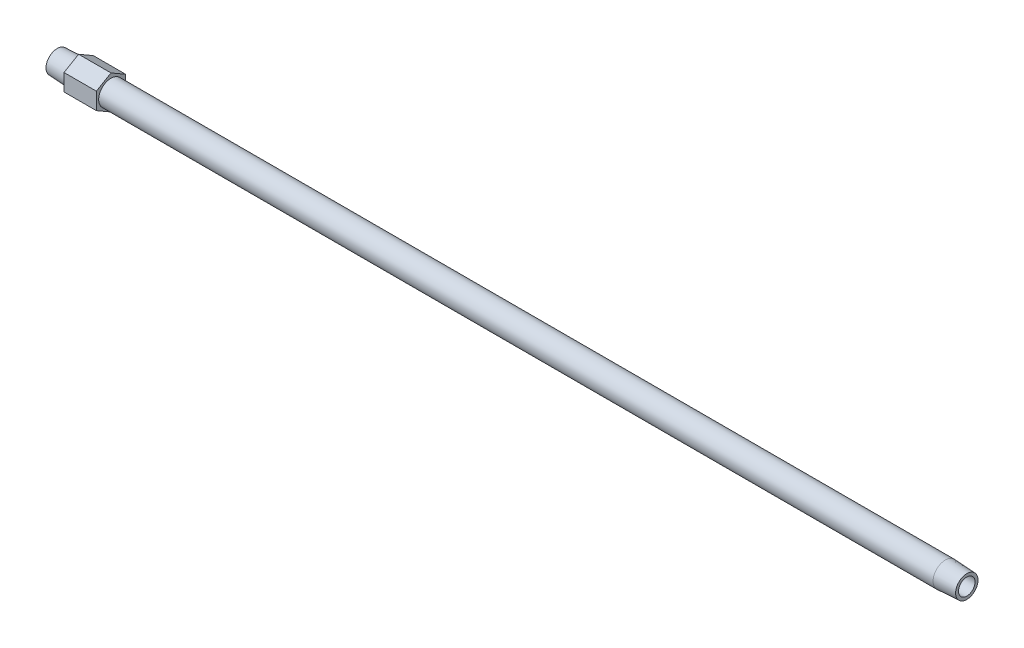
ISO-10303-21;
HEADER;
FILE_DESCRIPTION(('STEP AP214'),'2;1');
FILE_NAME('part.step','',(''),(''),'','','');
FILE_SCHEMA(('AUTOMOTIVE_DESIGN { 1 0 10303 214 1 1 1 1 }'));
ENDSEC;
DATA;
#1=APPLICATION_CONTEXT('core data for automotive mechanical design processes');
#2=APPLICATION_PROTOCOL_DEFINITION('international standard','automotive_design',2000,#1);
#3=PRODUCT_CONTEXT('',#1,'mechanical');
#4=PRODUCT('Part','Part','',(#3));
#5=PRODUCT_RELATED_PRODUCT_CATEGORY('part','',(#4));
#6=PRODUCT_DEFINITION_FORMATION('','',#4);
#7=PRODUCT_DEFINITION_CONTEXT('part definition',#1,'design');
#8=PRODUCT_DEFINITION('design','',#6,#7);
#9=PRODUCT_DEFINITION_SHAPE('','',#8);
#10=(LENGTH_UNIT() NAMED_UNIT(*) SI_UNIT(.MILLI.,.METRE.));
#11=(NAMED_UNIT(*) PLANE_ANGLE_UNIT() SI_UNIT($,.RADIAN.));
#12=(NAMED_UNIT(*) SI_UNIT($,.STERADIAN.) SOLID_ANGLE_UNIT());
#13=UNCERTAINTY_MEASURE_WITH_UNIT(LENGTH_MEASURE(1.E-05),#10,'distance_accuracy_value','');
#14=(GEOMETRIC_REPRESENTATION_CONTEXT(3) GLOBAL_UNCERTAINTY_ASSIGNED_CONTEXT((#13)) GLOBAL_UNIT_ASSIGNED_CONTEXT((#10,
#11,#12)) REPRESENTATION_CONTEXT('',''));
#15=CARTESIAN_POINT('',(0.,0.,0.));
#16=DIRECTION('',(0.,0.,1.));
#17=DIRECTION('',(1.,0.,0.));
#18=AXIS2_PLACEMENT_3D('',#15,#16,#17);
#19=CARTESIAN_POINT('',(0.,0.,-3.59899397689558));
#20=DIRECTION('',(1.,0.,0.));
#21=DIRECTION('',(0.,0.,-1.));
#22=AXIS2_PLACEMENT_3D('',#19,#20,#21);
#23=PLANE('',#22);
#24=CARTESIAN_POINT('',(0.,0.,0.));
#25=DIRECTION('',(-1.,0.,0.));
#26=DIRECTION('',(0.,0.,1.));
#27=AXIS2_PLACEMENT_3D('',#24,#25,#26);
#28=CIRCLE('',#27,3.59899397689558);
#29=CARTESIAN_POINT('',(0.,0.,3.59899397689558));
#30=VERTEX_POINT('',#29);
#31=EDGE_CURVE('E147',#30,#30,#28,.T.);
#32=ORIENTED_EDGE('',*,*,#31,.T.);
#33=EDGE_LOOP('',(#32));
#34=FACE_BOUND('',#33,.T.);
#35=CARTESIAN_POINT('',(0.,0.,0.));
#36=DIRECTION('',(1.,0.,0.));
#37=DIRECTION('',(0.,0.,1.));
#38=AXIS2_PLACEMENT_3D('',#35,#36,#37);
#39=CIRCLE('',#38,2.6543);
#40=CARTESIAN_POINT('',(0.,0.,2.6543));
#41=VERTEX_POINT('',#40);
#42=EDGE_CURVE('E159',#41,#41,#39,.T.);
#43=ORIENTED_EDGE('',*,*,#42,.T.);
#44=EDGE_LOOP('',(#43));
#45=FACE_BOUND('',#44,.T.);
#46=ADVANCED_FACE('F15',(#34,#45),#23,.F.);
#47=CARTESIAN_POINT('',(292.1,0.,-3.59899397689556));
#48=DIRECTION('',(-1.,0.,0.));
#49=DIRECTION('',(0.,0.,1.));
#50=AXIS2_PLACEMENT_3D('',#47,#48,#49);
#51=PLANE('',#50);
#52=CARTESIAN_POINT('',(292.1,0.,0.));
#53=DIRECTION('',(-1.,0.,0.));
#54=DIRECTION('',(0.,0.,1.));
#55=AXIS2_PLACEMENT_3D('',#52,#53,#54);
#56=CIRCLE('',#55,3.59899397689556);
#57=CARTESIAN_POINT('',(292.1,0.,3.59899397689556));
#58=VERTEX_POINT('',#57);
#59=EDGE_CURVE('E150',#58,#58,#56,.T.);
#60=ORIENTED_EDGE('',*,*,#59,.F.);
#61=EDGE_LOOP('',(#60));
#62=FACE_BOUND('',#61,.T.);
#63=CARTESIAN_POINT('',(292.1,0.,0.));
#64=DIRECTION('',(-1.,0.,0.));
#65=DIRECTION('',(0.,0.,1.));
#66=AXIS2_PLACEMENT_3D('',#63,#64,#65);
#67=CIRCLE('',#66,2.6543);
#68=CARTESIAN_POINT('',(292.1,0.,2.6543));
#69=VERTEX_POINT('',#68);
#70=EDGE_CURVE('E156',#69,#69,#67,.F.);
#71=ORIENTED_EDGE('',*,*,#70,.F.);
#72=EDGE_LOOP('',(#71));
#73=FACE_BOUND('',#72,.T.);
#74=ADVANCED_FACE('F178',(#62,#73),#51,.F.);
#75=CARTESIAN_POINT('',(17.272,-2.71296891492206,-4.699));
#76=DIRECTION('',(1.,0.,0.));
#77=DIRECTION('',(0.,1.,0.));
#78=AXIS2_PLACEMENT_3D('',#75,#76,#77);
#79=PLANE('',#78);
#80=DIRECTION('',(0.,0.5,-0.866025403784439));
#81=VECTOR('',#80,1.);
#82=CARTESIAN_POINT('',(17.272,-5.4259378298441,0.));
#83=LINE('',#82,#81);
#84=CARTESIAN_POINT('',(17.272,-5.4259378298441,0.));
#85=VERTEX_POINT('',#84);
#86=CARTESIAN_POINT('',(17.272,-2.71296891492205,-4.699));
#87=VERTEX_POINT('',#86);
#88=EDGE_CURVE('E103',#85,#87,#83,.T.);
#89=ORIENTED_EDGE('',*,*,#88,.T.);
#90=DIRECTION('',(0.,1.,0.));
#91=VECTOR('',#90,1.);
#92=CARTESIAN_POINT('',(17.272,-2.71296891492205,-4.699));
#93=LINE('',#92,#91);
#94=CARTESIAN_POINT('',(17.272,2.71296891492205,-4.699));
#95=VERTEX_POINT('',#94);
#96=EDGE_CURVE('E83',#87,#95,#93,.T.);
#97=ORIENTED_EDGE('',*,*,#96,.T.);
#98=DIRECTION('',(0.,0.5,0.866025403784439));
#99=VECTOR('',#98,1.);
#100=CARTESIAN_POINT('',(17.272,2.71296891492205,-4.699));
#101=LINE('',#100,#99);
#102=CARTESIAN_POINT('',(17.272,5.4259378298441,0.));
#103=VERTEX_POINT('',#102);
#104=EDGE_CURVE('E102',#95,#103,#101,.T.);
#105=ORIENTED_EDGE('',*,*,#104,.T.);
#106=DIRECTION('',(0.,-0.5,0.866025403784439));
#107=VECTOR('',#106,1.);
#108=CARTESIAN_POINT('',(17.272,5.4259378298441,0.));
#109=LINE('',#108,#107);
#110=CARTESIAN_POINT('',(17.272,2.71296891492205,4.699));
#111=VERTEX_POINT('',#110);
#112=EDGE_CURVE('E105',#103,#111,#109,.T.);
#113=ORIENTED_EDGE('',*,*,#112,.T.);
#114=DIRECTION('',(0.,-1.,0.));
#115=VECTOR('',#114,1.);
#116=CARTESIAN_POINT('',(17.272,2.71296891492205,4.699));
#117=LINE('',#116,#115);
#118=CARTESIAN_POINT('',(17.272,-2.71296891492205,4.699));
#119=VERTEX_POINT('',#118);
#120=EDGE_CURVE('E35',#111,#119,#117,.T.);
#121=ORIENTED_EDGE('',*,*,#120,.T.);
#122=DIRECTION('',(0.,-0.5,-0.866025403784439));
#123=VECTOR('',#122,1.);
#124=CARTESIAN_POINT('',(17.272,-2.71296891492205,4.699));
#125=LINE('',#124,#123);
#126=EDGE_CURVE('E30',#119,#85,#125,.T.);
#127=ORIENTED_EDGE('',*,*,#126,.T.);
#128=EDGE_LOOP('',(#89,#97,#105,#113,#121,#127));
#129=FACE_BOUND('',#128,.T.);
#130=CARTESIAN_POINT('',(17.272,0.,0.));
#131=DIRECTION('',(1.,0.,0.));
#132=DIRECTION('',(0.,1.,0.));
#133=AXIS2_PLACEMENT_3D('',#130,#131,#132);
#134=CIRCLE('',#133,3.95973768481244);
#135=CARTESIAN_POINT('',(17.272,3.95973768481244,0.));
#136=VERTEX_POINT('',#135);
#137=EDGE_CURVE('E89',#136,#136,#134,.F.);
#138=ORIENTED_EDGE('',*,*,#137,.T.);
#139=EDGE_LOOP('',(#138));
#140=FACE_BOUND('',#139,.T.);
#141=ADVANCED_FACE('F124',(#129,#140),#79,.T.);
#142=CARTESIAN_POINT('',(6.8834,-2.71296891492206,-4.699));
#143=DIRECTION('',(1.,0.,0.));
#144=DIRECTION('',(0.,1.,0.));
#145=AXIS2_PLACEMENT_3D('',#142,#143,#144);
#146=PLANE('',#145);
#147=DIRECTION('',(0.,0.5,-0.866025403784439));
#148=VECTOR('',#147,1.);
#149=CARTESIAN_POINT('',(6.8834,-5.4259378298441,0.));
#150=LINE('',#149,#148);
#151=CARTESIAN_POINT('',(6.8834,-5.4259378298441,0.));
#152=VERTEX_POINT('',#151);
#153=CARTESIAN_POINT('',(6.8834,-2.71296891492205,-4.699));
#154=VERTEX_POINT('',#153);
#155=EDGE_CURVE('E73',#152,#154,#150,.T.);
#156=ORIENTED_EDGE('',*,*,#155,.F.);
#157=DIRECTION('',(0.,-0.5,-0.866025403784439));
#158=VECTOR('',#157,1.);
#159=CARTESIAN_POINT('',(6.8834,-2.71296891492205,4.699));
#160=LINE('',#159,#158);
#161=CARTESIAN_POINT('',(6.8834,-2.71296891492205,4.699));
#162=VERTEX_POINT('',#161);
#163=EDGE_CURVE('E99',#162,#152,#160,.T.);
#164=ORIENTED_EDGE('',*,*,#163,.F.);
#165=DIRECTION('',(0.,-1.,0.));
#166=VECTOR('',#165,1.);
#167=CARTESIAN_POINT('',(6.8834,2.71296891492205,4.699));
#168=LINE('',#167,#166);
#169=CARTESIAN_POINT('',(6.8834,2.71296891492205,4.699));
#170=VERTEX_POINT('',#169);
#171=EDGE_CURVE('E133',#170,#162,#168,.T.);
#172=ORIENTED_EDGE('',*,*,#171,.F.);
#173=DIRECTION('',(0.,-0.5,0.866025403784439));
#174=VECTOR('',#173,1.);
#175=CARTESIAN_POINT('',(6.8834,5.4259378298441,0.));
#176=LINE('',#175,#174);
#177=CARTESIAN_POINT('',(6.8834,5.4259378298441,0.));
#178=VERTEX_POINT('',#177);
#179=EDGE_CURVE('E129',#178,#170,#176,.T.);
#180=ORIENTED_EDGE('',*,*,#179,.F.);
#181=DIRECTION('',(0.,0.5,0.866025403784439));
#182=VECTOR('',#181,1.);
#183=CARTESIAN_POINT('',(6.8834,2.71296891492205,-4.699));
#184=LINE('',#183,#182);
#185=CARTESIAN_POINT('',(6.8834,2.71296891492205,-4.699));
#186=VERTEX_POINT('',#185);
#187=EDGE_CURVE('E75',#186,#178,#184,.T.);
#188=ORIENTED_EDGE('',*,*,#187,.F.);
#189=DIRECTION('',(0.,1.,0.));
#190=VECTOR('',#189,1.);
#191=CARTESIAN_POINT('',(6.8834,-2.71296891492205,-4.699));
#192=LINE('',#191,#190);
#193=EDGE_CURVE('E68',#154,#186,#192,.T.);
#194=ORIENTED_EDGE('',*,*,#193,.F.);
#195=EDGE_LOOP('',(#156,#164,#172,#180,#188,#194));
#196=FACE_BOUND('',#195,.T.);
#197=CARTESIAN_POINT('',(6.8834,0.,0.));
#198=DIRECTION('',(-1.,0.,0.));
#199=DIRECTION('',(0.,0.,1.));
#200=AXIS2_PLACEMENT_3D('',#197,#198,#199);
#201=CIRCLE('',#200,3.95973768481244);
#202=CARTESIAN_POINT('',(6.8834,0.,3.95973768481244));
#203=VERTEX_POINT('',#202);
#204=EDGE_CURVE('E95',#203,#203,#201,.T.);
#205=ORIENTED_EDGE('',*,*,#204,.F.);
#206=EDGE_LOOP('',(#205));
#207=FACE_BOUND('',#206,.T.);
#208=ADVANCED_FACE('F69',(#196,#207),#146,.F.);
#209=CARTESIAN_POINT('',(17.272,-5.4259378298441,0.));
#210=DIRECTION('',(0.,0.866025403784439,0.5));
#211=DIRECTION('',(0.,-0.5,0.866025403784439));
#212=AXIS2_PLACEMENT_3D('',#209,#210,#211);
#213=PLANE('',#212);
#214=ORIENTED_EDGE('',*,*,#155,.T.);
#215=DIRECTION('',(-1.,0.,0.));
#216=VECTOR('',#215,1.);
#217=CARTESIAN_POINT('',(17.272,-2.71296891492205,-4.699));
#218=LINE('',#217,#216);
#219=EDGE_CURVE('E10',#87,#154,#218,.T.);
#220=ORIENTED_EDGE('',*,*,#219,.F.);
#221=ORIENTED_EDGE('',*,*,#88,.F.);
#222=DIRECTION('',(-1.,0.,0.));
#223=VECTOR('',#222,1.);
#224=CARTESIAN_POINT('',(17.272,-5.4259378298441,0.));
#225=LINE('',#224,#223);
#226=EDGE_CURVE('E87',#85,#152,#225,.T.);
#227=ORIENTED_EDGE('',*,*,#226,.T.);
#228=EDGE_LOOP('',(#214,#220,#221,#227));
#229=FACE_BOUND('',#228,.T.);
#230=ADVANCED_FACE('F17',(#229),#213,.F.);
#231=CARTESIAN_POINT('',(17.272,-2.71296891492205,-4.699));
#232=DIRECTION('',(0.,0.,1.));
#233=DIRECTION('',(1.,0.,0.));
#234=AXIS2_PLACEMENT_3D('',#231,#232,#233);
#235=PLANE('',#234);
#236=ORIENTED_EDGE('',*,*,#193,.T.);
#237=DIRECTION('',(-1.,0.,0.));
#238=VECTOR('',#237,1.);
#239=CARTESIAN_POINT('',(17.272,2.71296891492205,-4.699));
#240=LINE('',#239,#238);
#241=EDGE_CURVE('E23',#95,#186,#240,.T.);
#242=ORIENTED_EDGE('',*,*,#241,.F.);
#243=ORIENTED_EDGE('',*,*,#96,.F.);
#244=ORIENTED_EDGE('',*,*,#219,.T.);
#245=EDGE_LOOP('',(#236,#242,#243,#244));
#246=FACE_BOUND('',#245,.T.);
#247=ADVANCED_FACE('F82',(#246),#235,.F.);
#248=CARTESIAN_POINT('',(17.272,2.71296891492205,-4.699));
#249=DIRECTION('',(0.,-0.866025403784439,0.5));
#250=DIRECTION('',(0.,-0.5,-0.866025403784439));
#251=AXIS2_PLACEMENT_3D('',#248,#249,#250);
#252=PLANE('',#251);
#253=ORIENTED_EDGE('',*,*,#187,.T.);
#254=DIRECTION('',(-1.,0.,0.));
#255=VECTOR('',#254,1.);
#256=CARTESIAN_POINT('',(17.272,5.4259378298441,0.));
#257=LINE('',#256,#255);
#258=EDGE_CURVE('E117',#103,#178,#257,.T.);
#259=ORIENTED_EDGE('',*,*,#258,.F.);
#260=ORIENTED_EDGE('',*,*,#104,.F.);
#261=ORIENTED_EDGE('',*,*,#241,.T.);
#262=EDGE_LOOP('',(#253,#259,#260,#261));
#263=FACE_BOUND('',#262,.T.);
#264=ADVANCED_FACE('F121',(#263),#252,.F.);
#265=CARTESIAN_POINT('',(17.272,5.4259378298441,0.));
#266=DIRECTION('',(0.,-0.866025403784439,-0.5));
#267=DIRECTION('',(0.,0.5,-0.866025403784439));
#268=AXIS2_PLACEMENT_3D('',#265,#266,#267);
#269=PLANE('',#268);
#270=ORIENTED_EDGE('',*,*,#179,.T.);
#271=DIRECTION('',(-1.,0.,0.));
#272=VECTOR('',#271,1.);
#273=CARTESIAN_POINT('',(17.272,2.71296891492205,4.699));
#274=LINE('',#273,#272);
#275=EDGE_CURVE('E114',#111,#170,#274,.T.);
#276=ORIENTED_EDGE('',*,*,#275,.F.);
#277=ORIENTED_EDGE('',*,*,#112,.F.);
#278=ORIENTED_EDGE('',*,*,#258,.T.);
#279=EDGE_LOOP('',(#270,#276,#277,#278));
#280=FACE_BOUND('',#279,.T.);
#281=ADVANCED_FACE('F128',(#280),#269,.F.);
#282=CARTESIAN_POINT('',(17.272,2.71296891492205,4.699));
#283=DIRECTION('',(0.,0.,-1.));
#284=DIRECTION('',(-1.,0.,0.));
#285=AXIS2_PLACEMENT_3D('',#282,#283,#284);
#286=PLANE('',#285);
#287=ORIENTED_EDGE('',*,*,#171,.T.);
#288=DIRECTION('',(-1.,0.,0.));
#289=VECTOR('',#288,1.);
#290=CARTESIAN_POINT('',(17.272,-2.71296891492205,4.699));
#291=LINE('',#290,#289);
#292=EDGE_CURVE('E111',#119,#162,#291,.T.);
#293=ORIENTED_EDGE('',*,*,#292,.F.);
#294=ORIENTED_EDGE('',*,*,#120,.F.);
#295=ORIENTED_EDGE('',*,*,#275,.T.);
#296=EDGE_LOOP('',(#287,#293,#294,#295));
#297=FACE_BOUND('',#296,.T.);
#298=ADVANCED_FACE('F132',(#297),#286,.F.);
#299=CARTESIAN_POINT('',(17.272,-2.71296891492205,4.699));
#300=DIRECTION('',(0.,0.866025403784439,-0.5));
#301=DIRECTION('',(0.,0.5,0.866025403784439));
#302=AXIS2_PLACEMENT_3D('',#299,#300,#301);
#303=PLANE('',#302);
#304=ORIENTED_EDGE('',*,*,#163,.T.);
#305=ORIENTED_EDGE('',*,*,#226,.F.);
#306=ORIENTED_EDGE('',*,*,#126,.F.);
#307=ORIENTED_EDGE('',*,*,#292,.T.);
#308=EDGE_LOOP('',(#304,#305,#306,#307));
#309=FACE_BOUND('',#308,.T.);
#310=ADVANCED_FACE('F135',(#309),#303,.F.);
#311=CARTESIAN_POINT('',(6.8834,0.,0.));
#312=DIRECTION('',(1.,0.,0.));
#313=DIRECTION('',(0.,0.,-1.));
#314=AXIS2_PLACEMENT_3D('',#311,#312,#313);
#315=CONICAL_SURFACE('',#314,3.95973768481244,0.0523598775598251);
#316=ORIENTED_EDGE('',*,*,#31,.F.);
#317=EDGE_LOOP('',(#316));
#318=FACE_BOUND('',#317,.T.);
#319=ORIENTED_EDGE('',*,*,#204,.T.);
#320=EDGE_LOOP('',(#319));
#321=FACE_BOUND('',#320,.T.);
#322=ADVANCED_FACE('F187',(#318,#321),#315,.T.);
#323=CARTESIAN_POINT('',(-60.,0.,0.));
#324=DIRECTION('',(-1.,0.,0.));
#325=DIRECTION('',(0.,0.,1.));
#326=AXIS2_PLACEMENT_3D('',#323,#324,#325);
#327=CYLINDRICAL_SURFACE('',#326,3.95973768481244);
#328=ORIENTED_EDGE('',*,*,#137,.F.);
#329=EDGE_LOOP('',(#328));
#330=FACE_BOUND('',#329,.T.);
#331=CARTESIAN_POINT('',(285.2166,0.,0.));
#332=DIRECTION('',(-1.,0.,0.));
#333=DIRECTION('',(0.,0.,1.));
#334=AXIS2_PLACEMENT_3D('',#331,#332,#333);
#335=CIRCLE('',#334,3.95973768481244);
#336=CARTESIAN_POINT('',(285.2166,0.,3.95973768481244));
#337=VERTEX_POINT('',#336);
#338=EDGE_CURVE('E153',#337,#337,#335,.T.);
#339=ORIENTED_EDGE('',*,*,#338,.T.);
#340=EDGE_LOOP('',(#339));
#341=FACE_BOUND('',#340,.T.);
#342=ADVANCED_FACE('F174',(#330,#341),#327,.T.);
#343=CARTESIAN_POINT('',(292.1,0.,0.));
#344=DIRECTION('',(-1.,0.,0.));
#345=DIRECTION('',(0.,0.,1.));
#346=AXIS2_PLACEMENT_3D('',#343,#344,#345);
#347=CONICAL_SURFACE('',#346,3.59899397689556,0.052359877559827);
#348=ORIENTED_EDGE('',*,*,#338,.F.);
#349=EDGE_LOOP('',(#348));
#350=FACE_BOUND('',#349,.T.);
#351=ORIENTED_EDGE('',*,*,#59,.T.);
#352=EDGE_LOOP('',(#351));
#353=FACE_BOUND('',#352,.T.);
#354=ADVANCED_FACE('F167',(#350,#353),#347,.T.);
#355=CARTESIAN_POINT('',(292.452552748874,0.,0.));
#356=DIRECTION('',(-1.,0.,0.));
#357=DIRECTION('',(0.,0.,1.));
#358=AXIS2_PLACEMENT_3D('',#355,#356,#357);
#359=CYLINDRICAL_SURFACE('',#358,2.6543);
#360=ORIENTED_EDGE('',*,*,#70,.T.);
#361=EDGE_LOOP('',(#360));
#362=FACE_BOUND('',#361,.T.);
#363=ORIENTED_EDGE('',*,*,#42,.F.);
#364=EDGE_LOOP('',(#363));
#365=FACE_BOUND('',#364,.T.);
#366=ADVANCED_FACE('F165',(#362,#365),#359,.F.);
#367=CLOSED_SHELL('',(#46,#74,#141,#208,#230,#247,#264,#281,#298,#310,#322,#342,#354,#366));
#368=MANIFOLD_SOLID_BREP('B1',#367);
#369=ADVANCED_BREP_SHAPE_REPRESENTATION('',(#18,#368),#14);
#370=SHAPE_DEFINITION_REPRESENTATION(#9,#369);
ENDSEC;
END-ISO-10303-21;
